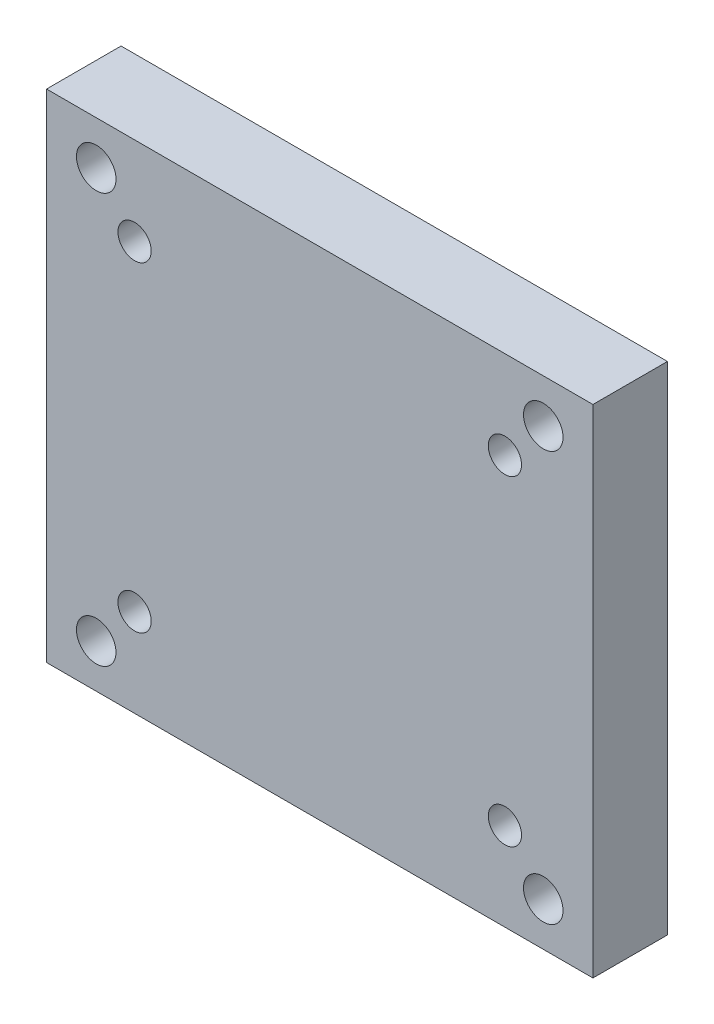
ISO-10303-21;
HEADER;
FILE_DESCRIPTION(('STEP AP214'),'2;1');
FILE_NAME('part.step','',(''),(''),'','','');
FILE_SCHEMA(('AUTOMOTIVE_DESIGN { 1 0 10303 214 1 1 1 1 }'));
ENDSEC;
DATA;
#1=APPLICATION_CONTEXT('core data for automotive mechanical design processes');
#2=APPLICATION_PROTOCOL_DEFINITION('international standard','automotive_design',2000,#1);
#3=PRODUCT_CONTEXT('',#1,'mechanical');
#4=PRODUCT('Part','Part','',(#3));
#5=PRODUCT_RELATED_PRODUCT_CATEGORY('part','',(#4));
#6=PRODUCT_DEFINITION_FORMATION('','',#4);
#7=PRODUCT_DEFINITION_CONTEXT('part definition',#1,'design');
#8=PRODUCT_DEFINITION('design','',#6,#7);
#9=PRODUCT_DEFINITION_SHAPE('','',#8);
#10=(LENGTH_UNIT() NAMED_UNIT(*) SI_UNIT(.MILLI.,.METRE.));
#11=(NAMED_UNIT(*) PLANE_ANGLE_UNIT() SI_UNIT($,.RADIAN.));
#12=(NAMED_UNIT(*) SI_UNIT($,.STERADIAN.) SOLID_ANGLE_UNIT());
#13=UNCERTAINTY_MEASURE_WITH_UNIT(LENGTH_MEASURE(1.E-05),#10,'distance_accuracy_value','');
#14=(GEOMETRIC_REPRESENTATION_CONTEXT(3) GLOBAL_UNCERTAINTY_ASSIGNED_CONTEXT((#13)) GLOBAL_UNIT_ASSIGNED_CONTEXT((#10,
#11,#12)) REPRESENTATION_CONTEXT('',''));
#15=CARTESIAN_POINT('',(0.,0.,0.));
#16=DIRECTION('',(0.,0.,1.));
#17=DIRECTION('',(1.,0.,0.));
#18=AXIS2_PLACEMENT_3D('',#15,#16,#17);
#19=CARTESIAN_POINT('',(-47.3455999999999,-40.9956,0.));
#20=DIRECTION('',(0.,0.,1.));
#21=DIRECTION('',(1.,0.,0.));
#22=AXIS2_PLACEMENT_3D('',#19,#20,#21);
#23=CYLINDRICAL_SURFACE('',#22,6.5);
#24=CARTESIAN_POINT('',(-47.3455999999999,-40.9956,8.));
#25=DIRECTION('',(0.,0.,1.));
#26=DIRECTION('',(1.,0.,0.));
#27=AXIS2_PLACEMENT_3D('',#24,#25,#26);
#28=CIRCLE('',#27,6.5);
#29=CARTESIAN_POINT('',(-40.8455999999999,-40.9956,8.));
#30=VERTEX_POINT('',#29);
#31=EDGE_CURVE('E19',#30,#30,#28,.T.);
#32=ORIENTED_EDGE('',*,*,#31,.T.);
#33=EDGE_LOOP('',(#32));
#34=FACE_BOUND('',#33,.T.);
#35=CARTESIAN_POINT('',(-47.3455999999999,-40.9956,0.));
#36=DIRECTION('',(0.,0.,1.));
#37=DIRECTION('',(1.,0.,0.));
#38=AXIS2_PLACEMENT_3D('',#35,#36,#37);
#39=CIRCLE('',#38,6.5);
#40=CARTESIAN_POINT('',(-40.8455999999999,-40.9956,0.));
#41=VERTEX_POINT('',#40);
#42=EDGE_CURVE('E137',#41,#41,#39,.F.);
#43=ORIENTED_EDGE('',*,*,#42,.T.);
#44=EDGE_LOOP('',(#43));
#45=FACE_BOUND('',#44,.T.);
#46=ADVANCED_FACE('F15',(#34,#45),#23,.F.);
#47=CARTESIAN_POINT('',(-47.3455999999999,40.9956,0.));
#48=DIRECTION('',(0.,0.,1.));
#49=DIRECTION('',(1.,0.,0.));
#50=AXIS2_PLACEMENT_3D('',#47,#48,#49);
#51=CYLINDRICAL_SURFACE('',#50,6.5);
#52=CARTESIAN_POINT('',(-47.3455999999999,40.9956,8.));
#53=DIRECTION('',(0.,0.,1.));
#54=DIRECTION('',(1.,0.,0.));
#55=AXIS2_PLACEMENT_3D('',#52,#53,#54);
#56=CIRCLE('',#55,6.5);
#57=CARTESIAN_POINT('',(-40.8455999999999,40.9956,8.));
#58=VERTEX_POINT('',#57);
#59=EDGE_CURVE('E146',#58,#58,#56,.T.);
#60=ORIENTED_EDGE('',*,*,#59,.T.);
#61=EDGE_LOOP('',(#60));
#62=FACE_BOUND('',#61,.T.);
#63=CARTESIAN_POINT('',(-47.3455999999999,40.9956,0.));
#64=DIRECTION('',(0.,0.,1.));
#65=DIRECTION('',(1.,0.,0.));
#66=AXIS2_PLACEMENT_3D('',#63,#64,#65);
#67=CIRCLE('',#66,6.5);
#68=CARTESIAN_POINT('',(-40.8455999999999,40.9956,0.));
#69=VERTEX_POINT('',#68);
#70=EDGE_CURVE('E134',#69,#69,#67,.F.);
#71=ORIENTED_EDGE('',*,*,#70,.T.);
#72=EDGE_LOOP('',(#71));
#73=FACE_BOUND('',#72,.T.);
#74=ADVANCED_FACE('F201',(#62,#73),#51,.F.);
#75=CARTESIAN_POINT('',(47.3455999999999,40.9956,0.));
#76=DIRECTION('',(0.,0.,1.));
#77=DIRECTION('',(1.,0.,0.));
#78=AXIS2_PLACEMENT_3D('',#75,#76,#77);
#79=CYLINDRICAL_SURFACE('',#78,6.5);
#80=CARTESIAN_POINT('',(47.3455999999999,40.9956,8.));
#81=DIRECTION('',(0.,0.,1.));
#82=DIRECTION('',(1.,0.,0.));
#83=AXIS2_PLACEMENT_3D('',#80,#81,#82);
#84=CIRCLE('',#83,6.5);
#85=CARTESIAN_POINT('',(53.8455999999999,40.9956,8.));
#86=VERTEX_POINT('',#85);
#87=EDGE_CURVE('E144',#86,#86,#84,.T.);
#88=ORIENTED_EDGE('',*,*,#87,.T.);
#89=EDGE_LOOP('',(#88));
#90=FACE_BOUND('',#89,.T.);
#91=CARTESIAN_POINT('',(47.3455999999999,40.9956,0.));
#92=DIRECTION('',(0.,0.,1.));
#93=DIRECTION('',(1.,0.,0.));
#94=AXIS2_PLACEMENT_3D('',#91,#92,#93);
#95=CIRCLE('',#94,6.5);
#96=CARTESIAN_POINT('',(53.8455999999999,40.9956,0.));
#97=VERTEX_POINT('',#96);
#98=EDGE_CURVE('E131',#97,#97,#95,.F.);
#99=ORIENTED_EDGE('',*,*,#98,.T.);
#100=EDGE_LOOP('',(#99));
#101=FACE_BOUND('',#100,.T.);
#102=ADVANCED_FACE('F169',(#90,#101),#79,.F.);
#103=CARTESIAN_POINT('',(47.3455999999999,-40.9956,0.));
#104=DIRECTION('',(0.,0.,1.));
#105=DIRECTION('',(1.,0.,0.));
#106=AXIS2_PLACEMENT_3D('',#103,#104,#105);
#107=CYLINDRICAL_SURFACE('',#106,6.5);
#108=CARTESIAN_POINT('',(47.3455999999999,-40.9956,8.));
#109=DIRECTION('',(0.,0.,1.));
#110=DIRECTION('',(1.,0.,0.));
#111=AXIS2_PLACEMENT_3D('',#108,#109,#110);
#112=CIRCLE('',#111,6.5);
#113=CARTESIAN_POINT('',(53.8455999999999,-40.9956,8.));
#114=VERTEX_POINT('',#113);
#115=EDGE_CURVE('E141',#114,#114,#112,.T.);
#116=ORIENTED_EDGE('',*,*,#115,.T.);
#117=EDGE_LOOP('',(#116));
#118=FACE_BOUND('',#117,.T.);
#119=CARTESIAN_POINT('',(47.3455999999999,-40.9956,0.));
#120=DIRECTION('',(0.,0.,1.));
#121=DIRECTION('',(1.,0.,0.));
#122=AXIS2_PLACEMENT_3D('',#119,#120,#121);
#123=CIRCLE('',#122,6.5);
#124=CARTESIAN_POINT('',(53.8455999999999,-40.9956,0.));
#125=VERTEX_POINT('',#124);
#126=EDGE_CURVE('E68',#125,#125,#123,.F.);
#127=ORIENTED_EDGE('',*,*,#126,.T.);
#128=EDGE_LOOP('',(#127));
#129=FACE_BOUND('',#128,.T.);
#130=ADVANCED_FACE('F158',(#118,#129),#107,.F.);
#131=CARTESIAN_POINT('',(-40.7155999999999,-34.3656,8.));
#132=DIRECTION('',(0.,0.,1.));
#133=DIRECTION('',(-1.,0.,0.));
#134=AXIS2_PLACEMENT_3D('',#131,#132,#133);
#135=PLANE('',#134);
#136=CARTESIAN_POINT('',(-47.3455999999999,-40.9956,8.));
#137=DIRECTION('',(0.,0.,1.));
#138=DIRECTION('',(1.,0.,0.));
#139=AXIS2_PLACEMENT_3D('',#136,#137,#138);
#140=CIRCLE('',#139,4.25);
#141=CARTESIAN_POINT('',(-43.0955999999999,-40.9956,8.));
#142=VERTEX_POINT('',#141);
#143=EDGE_CURVE('E126',#142,#142,#140,.T.);
#144=ORIENTED_EDGE('',*,*,#143,.T.);
#145=EDGE_LOOP('',(#144));
#146=FACE_BOUND('',#145,.T.);
#147=ORIENTED_EDGE('',*,*,#31,.F.);
#148=EDGE_LOOP('',(#147));
#149=FACE_BOUND('',#148,.T.);
#150=ADVANCED_FACE('F155',(#146,#149),#135,.F.);
#151=CARTESIAN_POINT('',(-40.7155999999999,47.6256,8.));
#152=DIRECTION('',(0.,0.,1.));
#153=DIRECTION('',(-1.,0.,0.));
#154=AXIS2_PLACEMENT_3D('',#151,#152,#153);
#155=PLANE('',#154);
#156=CARTESIAN_POINT('',(-47.3455999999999,40.9956,8.));
#157=DIRECTION('',(0.,0.,1.));
#158=DIRECTION('',(1.,0.,0.));
#159=AXIS2_PLACEMENT_3D('',#156,#157,#158);
#160=CIRCLE('',#159,4.24999999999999);
#161=CARTESIAN_POINT('',(-43.0955999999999,40.9956,8.));
#162=VERTEX_POINT('',#161);
#163=EDGE_CURVE('E123',#162,#162,#160,.T.);
#164=ORIENTED_EDGE('',*,*,#163,.T.);
#165=EDGE_LOOP('',(#164));
#166=FACE_BOUND('',#165,.T.);
#167=ORIENTED_EDGE('',*,*,#59,.F.);
#168=EDGE_LOOP('',(#167));
#169=FACE_BOUND('',#168,.T.);
#170=ADVANCED_FACE('F157',(#166,#169),#155,.F.);
#171=CARTESIAN_POINT('',(53.9755999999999,47.6256,8.));
#172=DIRECTION('',(0.,0.,1.));
#173=DIRECTION('',(-1.,0.,0.));
#174=AXIS2_PLACEMENT_3D('',#171,#172,#173);
#175=PLANE('',#174);
#176=CARTESIAN_POINT('',(47.3455999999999,40.9956,8.));
#177=DIRECTION('',(0.,0.,1.));
#178=DIRECTION('',(1.,0.,0.));
#179=AXIS2_PLACEMENT_3D('',#176,#177,#178);
#180=CIRCLE('',#179,4.25);
#181=CARTESIAN_POINT('',(51.5955999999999,40.9956,8.));
#182=VERTEX_POINT('',#181);
#183=EDGE_CURVE('E120',#182,#182,#180,.T.);
#184=ORIENTED_EDGE('',*,*,#183,.T.);
#185=EDGE_LOOP('',(#184));
#186=FACE_BOUND('',#185,.T.);
#187=ORIENTED_EDGE('',*,*,#87,.F.);
#188=EDGE_LOOP('',(#187));
#189=FACE_BOUND('',#188,.T.);
#190=ADVANCED_FACE('F166',(#186,#189),#175,.F.);
#191=CARTESIAN_POINT('',(53.9755999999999,-34.3656,8.));
#192=DIRECTION('',(0.,0.,1.));
#193=DIRECTION('',(-1.,0.,0.));
#194=AXIS2_PLACEMENT_3D('',#191,#192,#193);
#195=PLANE('',#194);
#196=CARTESIAN_POINT('',(47.3455999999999,-40.9956,8.));
#197=DIRECTION('',(0.,0.,1.));
#198=DIRECTION('',(1.,0.,0.));
#199=AXIS2_PLACEMENT_3D('',#196,#197,#198);
#200=CIRCLE('',#199,4.25000000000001);
#201=CARTESIAN_POINT('',(51.5955999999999,-40.9956,8.));
#202=VERTEX_POINT('',#201);
#203=EDGE_CURVE('E117',#202,#202,#200,.T.);
#204=ORIENTED_EDGE('',*,*,#203,.T.);
#205=EDGE_LOOP('',(#204));
#206=FACE_BOUND('',#205,.T.);
#207=ORIENTED_EDGE('',*,*,#115,.F.);
#208=EDGE_LOOP('',(#207));
#209=FACE_BOUND('',#208,.T.);
#210=ADVANCED_FACE('F197',(#206,#209),#195,.F.);
#211=CARTESIAN_POINT('',(0.,0.,0.));
#212=DIRECTION('',(0.,0.,1.));
#213=DIRECTION('',(1.,0.,0.));
#214=AXIS2_PLACEMENT_3D('',#211,#212,#213);
#215=PLANE('',#214);
#216=CARTESIAN_POINT('',(-57.1499999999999,-52.3875,0.));
#217=DIRECTION('',(0.,0.,1.));
#218=DIRECTION('',(1.,0.,0.));
#219=AXIS2_PLACEMENT_3D('',#216,#217,#218);
#220=CIRCLE('',#219,5.05459999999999);
#221=CARTESIAN_POINT('',(-52.0953999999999,-52.3875,0.));
#222=VERTEX_POINT('',#221);
#223=EDGE_CURVE('E104',#222,#222,#220,.T.);
#224=ORIENTED_EDGE('',*,*,#223,.T.);
#225=EDGE_LOOP('',(#224));
#226=FACE_BOUND('',#225,.T.);
#227=CARTESIAN_POINT('',(-57.1499999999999,52.3875,0.));
#228=DIRECTION('',(0.,0.,1.));
#229=DIRECTION('',(1.,0.,0.));
#230=AXIS2_PLACEMENT_3D('',#227,#228,#229);
#231=CIRCLE('',#230,5.0546);
#232=CARTESIAN_POINT('',(-52.0953999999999,52.3875,0.));
#233=VERTEX_POINT('',#232);
#234=EDGE_CURVE('E108',#233,#233,#231,.T.);
#235=ORIENTED_EDGE('',*,*,#234,.T.);
#236=EDGE_LOOP('',(#235));
#237=FACE_BOUND('',#236,.T.);
#238=CARTESIAN_POINT('',(57.1499999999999,52.3875,0.));
#239=DIRECTION('',(0.,0.,1.));
#240=DIRECTION('',(1.,0.,0.));
#241=AXIS2_PLACEMENT_3D('',#238,#239,#240);
#242=CIRCLE('',#241,5.0546);
#243=CARTESIAN_POINT('',(62.2045999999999,52.3875,0.));
#244=VERTEX_POINT('',#243);
#245=EDGE_CURVE('E111',#244,#244,#242,.T.);
#246=ORIENTED_EDGE('',*,*,#245,.T.);
#247=EDGE_LOOP('',(#246));
#248=FACE_BOUND('',#247,.T.);
#249=CARTESIAN_POINT('',(57.1499999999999,-52.3875,0.));
#250=DIRECTION('',(0.,0.,1.));
#251=DIRECTION('',(1.,0.,0.));
#252=AXIS2_PLACEMENT_3D('',#249,#250,#251);
#253=CIRCLE('',#252,5.0546);
#254=CARTESIAN_POINT('',(62.2045999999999,-52.3875,0.));
#255=VERTEX_POINT('',#254);
#256=EDGE_CURVE('E114',#255,#255,#253,.T.);
#257=ORIENTED_EDGE('',*,*,#256,.T.);
#258=EDGE_LOOP('',(#257));
#259=FACE_BOUND('',#258,.T.);
#260=ORIENTED_EDGE('',*,*,#126,.F.);
#261=EDGE_LOOP('',(#260));
#262=FACE_BOUND('',#261,.T.);
#263=ORIENTED_EDGE('',*,*,#98,.F.);
#264=EDGE_LOOP('',(#263));
#265=FACE_BOUND('',#264,.T.);
#266=ORIENTED_EDGE('',*,*,#70,.F.);
#267=EDGE_LOOP('',(#266));
#268=FACE_BOUND('',#267,.T.);
#269=ORIENTED_EDGE('',*,*,#42,.F.);
#270=EDGE_LOOP('',(#269));
#271=FACE_BOUND('',#270,.T.);
#272=DIRECTION('',(0.,1.,0.));
#273=VECTOR('',#272,1.);
#274=CARTESIAN_POINT('',(-69.8499999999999,-63.4999999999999,0.));
#275=LINE('',#274,#273);
#276=CARTESIAN_POINT('',(-69.85,63.4999999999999,0.));
#277=VERTEX_POINT('',#276);
#278=CARTESIAN_POINT('',(-69.8499999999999,-63.4999999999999,0.));
#279=VERTEX_POINT('',#278);
#280=EDGE_CURVE('E59',#277,#279,#275,.F.);
#281=ORIENTED_EDGE('',*,*,#280,.F.);
#282=DIRECTION('',(1.,0.,0.));
#283=VECTOR('',#282,1.);
#284=CARTESIAN_POINT('',(-69.85,63.4999999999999,0.));
#285=LINE('',#284,#283);
#286=CARTESIAN_POINT('',(69.8499999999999,63.4999999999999,0.));
#287=VERTEX_POINT('',#286);
#288=EDGE_CURVE('E289',#287,#277,#285,.F.);
#289=ORIENTED_EDGE('',*,*,#288,.F.);
#290=DIRECTION('',(0.,1.,0.));
#291=VECTOR('',#290,1.);
#292=CARTESIAN_POINT('',(69.85,63.4999999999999,0.));
#293=LINE('',#292,#291);
#294=CARTESIAN_POINT('',(69.8499999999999,-63.4999999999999,0.));
#295=VERTEX_POINT('',#294);
#296=EDGE_CURVE('E71',#295,#287,#293,.T.);
#297=ORIENTED_EDGE('',*,*,#296,.F.);
#298=DIRECTION('',(1.,0.,0.));
#299=VECTOR('',#298,1.);
#300=CARTESIAN_POINT('',(69.8499999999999,-63.4999999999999,0.));
#301=LINE('',#300,#299);
#302=EDGE_CURVE('E54',#279,#295,#301,.T.);
#303=ORIENTED_EDGE('',*,*,#302,.F.);
#304=EDGE_LOOP('',(#281,#289,#297,#303));
#305=FACE_BOUND('',#304,.T.);
#306=ADVANCED_FACE('F70',(#226,#237,#248,#259,#262,#265,#268,#271,#305),#215,.F.);
#307=CARTESIAN_POINT('',(-69.8499999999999,-63.4999999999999,0.));
#308=DIRECTION('',(-1.,0.,0.));
#309=DIRECTION('',(0.,0.,1.));
#310=AXIS2_PLACEMENT_3D('',#307,#308,#309);
#311=PLANE('',#310);
#312=ORIENTED_EDGE('',*,*,#280,.T.);
#313=DIRECTION('',(0.,0.,-1.));
#314=VECTOR('',#313,1.);
#315=CARTESIAN_POINT('',(-69.8499999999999,-63.4999999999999,0.));
#316=LINE('',#315,#314);
#317=CARTESIAN_POINT('',(-69.8499999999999,-63.4999999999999,19.05));
#318=VERTEX_POINT('',#317);
#319=EDGE_CURVE('E61',#318,#279,#316,.T.);
#320=ORIENTED_EDGE('',*,*,#319,.F.);
#321=DIRECTION('',(0.,1.,0.));
#322=VECTOR('',#321,1.);
#323=CARTESIAN_POINT('',(-69.85,0.,19.05));
#324=LINE('',#323,#322);
#325=CARTESIAN_POINT('',(-69.8499999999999,63.4999999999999,19.05));
#326=VERTEX_POINT('',#325);
#327=EDGE_CURVE('E107',#326,#318,#324,.F.);
#328=ORIENTED_EDGE('',*,*,#327,.F.);
#329=DIRECTION('',(0.,0.,1.));
#330=VECTOR('',#329,1.);
#331=CARTESIAN_POINT('',(-69.85,63.4999999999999,0.));
#332=LINE('',#331,#330);
#333=EDGE_CURVE('E64',#277,#326,#332,.T.);
#334=ORIENTED_EDGE('',*,*,#333,.F.);
#335=EDGE_LOOP('',(#312,#320,#328,#334));
#336=FACE_BOUND('',#335,.T.);
#337=ADVANCED_FACE('F60',(#336),#311,.T.);
#338=CARTESIAN_POINT('',(69.8499999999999,-63.4999999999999,0.));
#339=DIRECTION('',(0.,-1.,0.));
#340=DIRECTION('',(0.,0.,-1.));
#341=AXIS2_PLACEMENT_3D('',#338,#339,#340);
#342=PLANE('',#341);
#343=ORIENTED_EDGE('',*,*,#302,.T.);
#344=DIRECTION('',(0.,0.,-1.));
#345=VECTOR('',#344,1.);
#346=CARTESIAN_POINT('',(69.85,-63.5,0.));
#347=LINE('',#346,#345);
#348=CARTESIAN_POINT('',(69.8499999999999,-63.4999999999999,19.05));
#349=VERTEX_POINT('',#348);
#350=EDGE_CURVE('E74',#349,#295,#347,.T.);
#351=ORIENTED_EDGE('',*,*,#350,.F.);
#352=DIRECTION('',(1.,0.,0.));
#353=VECTOR('',#352,1.);
#354=CARTESIAN_POINT('',(0.,-63.4999999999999,19.05));
#355=LINE('',#354,#353);
#356=EDGE_CURVE('E78',#318,#349,#355,.T.);
#357=ORIENTED_EDGE('',*,*,#356,.F.);
#358=ORIENTED_EDGE('',*,*,#319,.T.);
#359=EDGE_LOOP('',(#343,#351,#357,#358));
#360=FACE_BOUND('',#359,.T.);
#361=ADVANCED_FACE('F76',(#360),#342,.T.);
#362=CARTESIAN_POINT('',(69.85,63.4999999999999,0.));
#363=DIRECTION('',(1.,0.,0.));
#364=DIRECTION('',(0.,0.,-1.));
#365=AXIS2_PLACEMENT_3D('',#362,#363,#364);
#366=PLANE('',#365);
#367=ORIENTED_EDGE('',*,*,#296,.T.);
#368=DIRECTION('',(0.,0.,1.));
#369=VECTOR('',#368,1.);
#370=CARTESIAN_POINT('',(69.85,63.4999999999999,0.));
#371=LINE('',#370,#369);
#372=CARTESIAN_POINT('',(69.8499999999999,63.4999999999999,19.05));
#373=VERTEX_POINT('',#372);
#374=EDGE_CURVE('E34',#373,#287,#371,.F.);
#375=ORIENTED_EDGE('',*,*,#374,.F.);
#376=DIRECTION('',(0.,1.,0.));
#377=VECTOR('',#376,1.);
#378=CARTESIAN_POINT('',(69.8499999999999,0.,19.05));
#379=LINE('',#378,#377);
#380=EDGE_CURVE('E281',#349,#373,#379,.T.);
#381=ORIENTED_EDGE('',*,*,#380,.F.);
#382=ORIENTED_EDGE('',*,*,#350,.T.);
#383=EDGE_LOOP('',(#367,#375,#381,#382));
#384=FACE_BOUND('',#383,.T.);
#385=ADVANCED_FACE('F187',(#384),#366,.T.);
#386=CARTESIAN_POINT('',(-69.85,63.4999999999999,0.));
#387=DIRECTION('',(0.,1.,0.));
#388=DIRECTION('',(0.,0.,1.));
#389=AXIS2_PLACEMENT_3D('',#386,#387,#388);
#390=PLANE('',#389);
#391=ORIENTED_EDGE('',*,*,#288,.T.);
#392=ORIENTED_EDGE('',*,*,#333,.T.);
#393=DIRECTION('',(1.,0.,0.));
#394=VECTOR('',#393,1.);
#395=CARTESIAN_POINT('',(0.,63.4999999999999,19.05));
#396=LINE('',#395,#394);
#397=EDGE_CURVE('E103',#373,#326,#396,.F.);
#398=ORIENTED_EDGE('',*,*,#397,.F.);
#399=ORIENTED_EDGE('',*,*,#374,.T.);
#400=EDGE_LOOP('',(#391,#392,#398,#399));
#401=FACE_BOUND('',#400,.T.);
#402=ADVANCED_FACE('F183',(#401),#390,.T.);
#403=CARTESIAN_POINT('',(-47.3455999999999,-40.9956,8.00000000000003));
#404=DIRECTION('',(0.,0.,1.));
#405=DIRECTION('',(1.,0.,0.));
#406=AXIS2_PLACEMENT_3D('',#403,#404,#405);
#407=CYLINDRICAL_SURFACE('',#406,4.25);
#408=ORIENTED_EDGE('',*,*,#143,.F.);
#409=EDGE_LOOP('',(#408));
#410=FACE_BOUND('',#409,.T.);
#411=CARTESIAN_POINT('',(-47.3455999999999,-40.9956,19.05));
#412=DIRECTION('',(0.,0.,1.));
#413=DIRECTION('',(1.,0.,0.));
#414=AXIS2_PLACEMENT_3D('',#411,#412,#413);
#415=CIRCLE('',#414,4.25);
#416=CARTESIAN_POINT('',(-43.0955999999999,-40.9956,19.05));
#417=VERTEX_POINT('',#416);
#418=EDGE_CURVE('E100',#417,#417,#415,.F.);
#419=ORIENTED_EDGE('',*,*,#418,.F.);
#420=EDGE_LOOP('',(#419));
#421=FACE_BOUND('',#420,.T.);
#422=ADVANCED_FACE('F186',(#410,#421),#407,.F.);
#423=CARTESIAN_POINT('',(-47.3455999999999,40.9956,8.00000000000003));
#424=DIRECTION('',(0.,0.,1.));
#425=DIRECTION('',(1.,0.,0.));
#426=AXIS2_PLACEMENT_3D('',#423,#424,#425);
#427=CYLINDRICAL_SURFACE('',#426,4.24999999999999);
#428=ORIENTED_EDGE('',*,*,#163,.F.);
#429=EDGE_LOOP('',(#428));
#430=FACE_BOUND('',#429,.T.);
#431=CARTESIAN_POINT('',(-47.3455999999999,40.9956,19.05));
#432=DIRECTION('',(0.,0.,1.));
#433=DIRECTION('',(1.,0.,0.));
#434=AXIS2_PLACEMENT_3D('',#431,#432,#433);
#435=CIRCLE('',#434,4.24999999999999);
#436=CARTESIAN_POINT('',(-43.0955999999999,40.9956,19.05));
#437=VERTEX_POINT('',#436);
#438=EDGE_CURVE('E97',#437,#437,#435,.F.);
#439=ORIENTED_EDGE('',*,*,#438,.F.);
#440=EDGE_LOOP('',(#439));
#441=FACE_BOUND('',#440,.T.);
#442=ADVANCED_FACE('F229',(#430,#441),#427,.F.);
#443=CARTESIAN_POINT('',(47.3455999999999,40.9956,8.00000000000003));
#444=DIRECTION('',(0.,0.,1.));
#445=DIRECTION('',(1.,0.,0.));
#446=AXIS2_PLACEMENT_3D('',#443,#444,#445);
#447=CYLINDRICAL_SURFACE('',#446,4.25);
#448=ORIENTED_EDGE('',*,*,#183,.F.);
#449=EDGE_LOOP('',(#448));
#450=FACE_BOUND('',#449,.T.);
#451=CARTESIAN_POINT('',(47.3455999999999,40.9956,19.05));
#452=DIRECTION('',(0.,0.,1.));
#453=DIRECTION('',(1.,0.,0.));
#454=AXIS2_PLACEMENT_3D('',#451,#452,#453);
#455=CIRCLE('',#454,4.25);
#456=CARTESIAN_POINT('',(51.5955999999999,40.9956,19.05));
#457=VERTEX_POINT('',#456);
#458=EDGE_CURVE('E94',#457,#457,#455,.F.);
#459=ORIENTED_EDGE('',*,*,#458,.F.);
#460=EDGE_LOOP('',(#459));
#461=FACE_BOUND('',#460,.T.);
#462=ADVANCED_FACE('F233',(#450,#461),#447,.F.);
#463=CARTESIAN_POINT('',(47.3455999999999,-40.9956,8.00000000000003));
#464=DIRECTION('',(0.,0.,1.));
#465=DIRECTION('',(1.,0.,0.));
#466=AXIS2_PLACEMENT_3D('',#463,#464,#465);
#467=CYLINDRICAL_SURFACE('',#466,4.25000000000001);
#468=ORIENTED_EDGE('',*,*,#203,.F.);
#469=EDGE_LOOP('',(#468));
#470=FACE_BOUND('',#469,.T.);
#471=CARTESIAN_POINT('',(47.3455999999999,-40.9956,19.05));
#472=DIRECTION('',(0.,0.,1.));
#473=DIRECTION('',(1.,0.,0.));
#474=AXIS2_PLACEMENT_3D('',#471,#472,#473);
#475=CIRCLE('',#474,4.25000000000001);
#476=CARTESIAN_POINT('',(51.5955999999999,-40.9956,19.05));
#477=VERTEX_POINT('',#476);
#478=EDGE_CURVE('E91',#477,#477,#475,.F.);
#479=ORIENTED_EDGE('',*,*,#478,.F.);
#480=EDGE_LOOP('',(#479));
#481=FACE_BOUND('',#480,.T.);
#482=ADVANCED_FACE('F237',(#470,#481),#467,.F.);
#483=CARTESIAN_POINT('',(57.1499999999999,-52.3875,0.));
#484=DIRECTION('',(0.,0.,1.));
#485=DIRECTION('',(1.,0.,0.));
#486=AXIS2_PLACEMENT_3D('',#483,#484,#485);
#487=CYLINDRICAL_SURFACE('',#486,5.0546);
#488=CARTESIAN_POINT('',(57.1499999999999,-52.3875,19.05));
#489=DIRECTION('',(0.,0.,1.));
#490=DIRECTION('',(1.,0.,0.));
#491=AXIS2_PLACEMENT_3D('',#488,#489,#490);
#492=CIRCLE('',#491,5.0546);
#493=CARTESIAN_POINT('',(62.2045999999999,-52.3875,19.05));
#494=VERTEX_POINT('',#493);
#495=EDGE_CURVE('E88',#494,#494,#492,.F.);
#496=ORIENTED_EDGE('',*,*,#495,.F.);
#497=EDGE_LOOP('',(#496));
#498=FACE_BOUND('',#497,.T.);
#499=ORIENTED_EDGE('',*,*,#256,.F.);
#500=EDGE_LOOP('',(#499));
#501=FACE_BOUND('',#500,.T.);
#502=ADVANCED_FACE('F241',(#498,#501),#487,.F.);
#503=CARTESIAN_POINT('',(57.1499999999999,52.3875,0.));
#504=DIRECTION('',(0.,0.,1.));
#505=DIRECTION('',(1.,0.,0.));
#506=AXIS2_PLACEMENT_3D('',#503,#504,#505);
#507=CYLINDRICAL_SURFACE('',#506,5.0546);
#508=CARTESIAN_POINT('',(57.1499999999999,52.3875,19.05));
#509=DIRECTION('',(0.,0.,1.));
#510=DIRECTION('',(1.,0.,0.));
#511=AXIS2_PLACEMENT_3D('',#508,#509,#510);
#512=CIRCLE('',#511,5.0546);
#513=CARTESIAN_POINT('',(62.2045999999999,52.3875,19.05));
#514=VERTEX_POINT('',#513);
#515=EDGE_CURVE('E85',#514,#514,#512,.F.);
#516=ORIENTED_EDGE('',*,*,#515,.F.);
#517=EDGE_LOOP('',(#516));
#518=FACE_BOUND('',#517,.T.);
#519=ORIENTED_EDGE('',*,*,#245,.F.);
#520=EDGE_LOOP('',(#519));
#521=FACE_BOUND('',#520,.T.);
#522=ADVANCED_FACE('F245',(#518,#521),#507,.F.);
#523=CARTESIAN_POINT('',(-57.1499999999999,52.3875,0.));
#524=DIRECTION('',(0.,0.,1.));
#525=DIRECTION('',(1.,0.,0.));
#526=AXIS2_PLACEMENT_3D('',#523,#524,#525);
#527=CYLINDRICAL_SURFACE('',#526,5.0546);
#528=CARTESIAN_POINT('',(-57.1499999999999,52.3875,19.05));
#529=DIRECTION('',(0.,0.,1.));
#530=DIRECTION('',(1.,0.,0.));
#531=AXIS2_PLACEMENT_3D('',#528,#529,#530);
#532=CIRCLE('',#531,5.0546);
#533=CARTESIAN_POINT('',(-52.0953999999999,52.3875,19.05));
#534=VERTEX_POINT('',#533);
#535=EDGE_CURVE('E25',#534,#534,#532,.F.);
#536=ORIENTED_EDGE('',*,*,#535,.F.);
#537=EDGE_LOOP('',(#536));
#538=FACE_BOUND('',#537,.T.);
#539=ORIENTED_EDGE('',*,*,#234,.F.);
#540=EDGE_LOOP('',(#539));
#541=FACE_BOUND('',#540,.T.);
#542=ADVANCED_FACE('F179',(#538,#541),#527,.F.);
#543=CARTESIAN_POINT('',(-57.1499999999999,-52.3875,0.));
#544=DIRECTION('',(0.,0.,1.));
#545=DIRECTION('',(1.,0.,0.));
#546=AXIS2_PLACEMENT_3D('',#543,#544,#545);
#547=CYLINDRICAL_SURFACE('',#546,5.05459999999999);
#548=CARTESIAN_POINT('',(-57.1499999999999,-52.3875,19.05));
#549=DIRECTION('',(0.,0.,1.));
#550=DIRECTION('',(1.,0.,0.));
#551=AXIS2_PLACEMENT_3D('',#548,#549,#550);
#552=CIRCLE('',#551,5.05459999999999);
#553=CARTESIAN_POINT('',(-52.0953999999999,-52.3875,19.05));
#554=VERTEX_POINT('',#553);
#555=EDGE_CURVE('E10',#554,#554,#552,.F.);
#556=ORIENTED_EDGE('',*,*,#555,.F.);
#557=EDGE_LOOP('',(#556));
#558=FACE_BOUND('',#557,.T.);
#559=ORIENTED_EDGE('',*,*,#223,.F.);
#560=EDGE_LOOP('',(#559));
#561=FACE_BOUND('',#560,.T.);
#562=ADVANCED_FACE('F17',(#558,#561),#547,.F.);
#563=CARTESIAN_POINT('',(0.,0.,19.05));
#564=DIRECTION('',(0.,0.,1.));
#565=DIRECTION('',(1.,0.,0.));
#566=AXIS2_PLACEMENT_3D('',#563,#564,#565);
#567=PLANE('',#566);
#568=ORIENTED_EDGE('',*,*,#555,.T.);
#569=EDGE_LOOP('',(#568));
#570=FACE_BOUND('',#569,.T.);
#571=ORIENTED_EDGE('',*,*,#535,.T.);
#572=EDGE_LOOP('',(#571));
#573=FACE_BOUND('',#572,.T.);
#574=ORIENTED_EDGE('',*,*,#515,.T.);
#575=EDGE_LOOP('',(#574));
#576=FACE_BOUND('',#575,.T.);
#577=ORIENTED_EDGE('',*,*,#495,.T.);
#578=EDGE_LOOP('',(#577));
#579=FACE_BOUND('',#578,.T.);
#580=ORIENTED_EDGE('',*,*,#478,.T.);
#581=EDGE_LOOP('',(#580));
#582=FACE_BOUND('',#581,.T.);
#583=ORIENTED_EDGE('',*,*,#458,.T.);
#584=EDGE_LOOP('',(#583));
#585=FACE_BOUND('',#584,.T.);
#586=ORIENTED_EDGE('',*,*,#438,.T.);
#587=EDGE_LOOP('',(#586));
#588=FACE_BOUND('',#587,.T.);
#589=ORIENTED_EDGE('',*,*,#418,.T.);
#590=EDGE_LOOP('',(#589));
#591=FACE_BOUND('',#590,.T.);
#592=ORIENTED_EDGE('',*,*,#380,.T.);
#593=ORIENTED_EDGE('',*,*,#397,.T.);
#594=ORIENTED_EDGE('',*,*,#327,.T.);
#595=ORIENTED_EDGE('',*,*,#356,.T.);
#596=EDGE_LOOP('',(#592,#593,#594,#595));
#597=FACE_BOUND('',#596,.T.);
#598=ADVANCED_FACE('F172',(#570,#573,#576,#579,#582,#585,#588,#591,#597),#567,.T.);
#599=CLOSED_SHELL('',(#46,#74,#102,#130,#150,#170,#190,#210,#306,#337,#361,#385,#402,#422,#442,
#462,#482,#502,#522,#542,#562,#598));
#600=MANIFOLD_SOLID_BREP('B1',#599);
#601=ADVANCED_BREP_SHAPE_REPRESENTATION('',(#18,#600),#14);
#602=SHAPE_DEFINITION_REPRESENTATION(#9,#601);
ENDSEC;
END-ISO-10303-21;
